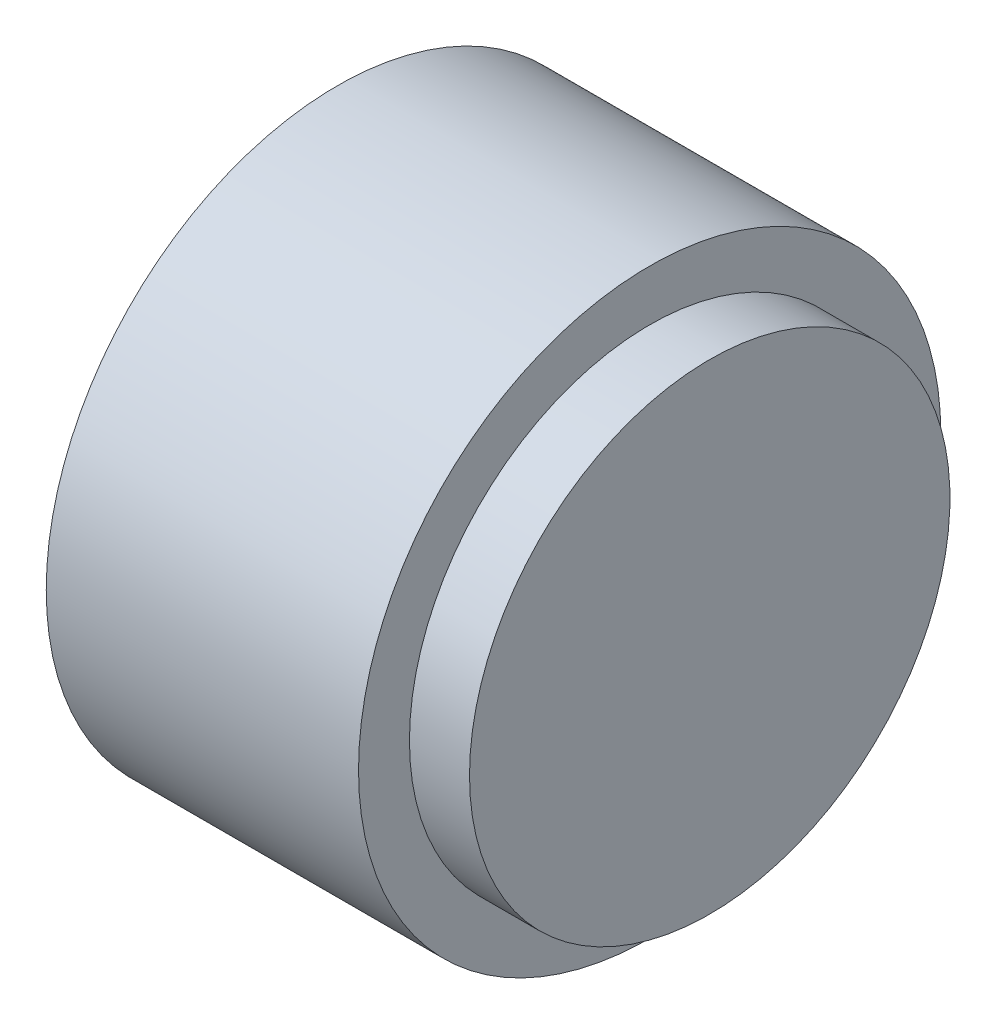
ISO-10303-21;
HEADER;
FILE_DESCRIPTION(('STEP AP214'),'2;1');
FILE_NAME('part.step','',(''),(''),'','','');
FILE_SCHEMA(('AUTOMOTIVE_DESIGN { 1 0 10303 214 1 1 1 1 }'));
ENDSEC;
DATA;
#1=APPLICATION_CONTEXT('core data for automotive mechanical design processes');
#2=APPLICATION_PROTOCOL_DEFINITION('international standard','automotive_design',2000,#1);
#3=PRODUCT_CONTEXT('',#1,'mechanical');
#4=PRODUCT('Part','Part','',(#3));
#5=PRODUCT_RELATED_PRODUCT_CATEGORY('part','',(#4));
#6=PRODUCT_DEFINITION_FORMATION('','',#4);
#7=PRODUCT_DEFINITION_CONTEXT('part definition',#1,'design');
#8=PRODUCT_DEFINITION('design','',#6,#7);
#9=PRODUCT_DEFINITION_SHAPE('','',#8);
#10=(LENGTH_UNIT() NAMED_UNIT(*) SI_UNIT(.MILLI.,.METRE.));
#11=(NAMED_UNIT(*) PLANE_ANGLE_UNIT() SI_UNIT($,.RADIAN.));
#12=(NAMED_UNIT(*) SI_UNIT($,.STERADIAN.) SOLID_ANGLE_UNIT());
#13=UNCERTAINTY_MEASURE_WITH_UNIT(LENGTH_MEASURE(1.E-05),#10,'distance_accuracy_value','');
#14=(GEOMETRIC_REPRESENTATION_CONTEXT(3) GLOBAL_UNCERTAINTY_ASSIGNED_CONTEXT((#13)) GLOBAL_UNIT_ASSIGNED_CONTEXT((#10,
#11,#12)) REPRESENTATION_CONTEXT('',''));
#15=CARTESIAN_POINT('',(0.,0.,0.));
#16=DIRECTION('',(0.,0.,1.));
#17=DIRECTION('',(1.,0.,0.));
#18=AXIS2_PLACEMENT_3D('',#15,#16,#17);
#19=CARTESIAN_POINT('',(0.,30.7848,0.));
#20=DIRECTION('',(1.,0.,0.));
#21=DIRECTION('',(0.,0.,-1.));
#22=AXIS2_PLACEMENT_3D('',#19,#20,#21);
#23=PLANE('',#22);
#24=CARTESIAN_POINT('',(0.,0.,0.));
#25=DIRECTION('',(-1.,0.,0.));
#26=DIRECTION('',(0.,0.,1.));
#27=AXIS2_PLACEMENT_3D('',#24,#25,#26);
#28=CIRCLE('',#27,30.7848);
#29=CARTESIAN_POINT('',(0.,0.,30.7848));
#30=VERTEX_POINT('',#29);
#31=EDGE_CURVE('E41',#30,#30,#28,.T.);
#32=ORIENTED_EDGE('',*,*,#31,.T.);
#33=EDGE_LOOP('',(#32));
#34=FACE_BOUND('',#33,.T.);
#35=ADVANCED_FACE('F27',(#34),#23,.F.);
#36=CARTESIAN_POINT('',(39.37,0.,0.));
#37=DIRECTION('',(-1.,0.,0.));
#38=DIRECTION('',(0.,0.,1.));
#39=AXIS2_PLACEMENT_3D('',#36,#37,#38);
#40=PLANE('',#39);
#41=CARTESIAN_POINT('',(39.37,0.,0.));
#42=DIRECTION('',(-1.,0.,0.));
#43=DIRECTION('',(0.,0.,1.));
#44=AXIS2_PLACEMENT_3D('',#41,#42,#43);
#45=CIRCLE('',#44,25.4);
#46=CARTESIAN_POINT('',(39.37,0.,25.4));
#47=VERTEX_POINT('',#46);
#48=EDGE_CURVE('E10',#47,#47,#45,.T.);
#49=ORIENTED_EDGE('',*,*,#48,.F.);
#50=EDGE_LOOP('',(#49));
#51=FACE_BOUND('',#50,.T.);
#52=ADVANCED_FACE('F61',(#51),#40,.F.);
#53=CARTESIAN_POINT('',(-81.4512072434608,0.,0.));
#54=DIRECTION('',(-1.,0.,0.));
#55=DIRECTION('',(0.,0.,1.));
#56=AXIS2_PLACEMENT_3D('',#53,#54,#55);
#57=CYLINDRICAL_SURFACE('',#56,25.4);
#58=CARTESIAN_POINT('',(33.02,0.,0.));
#59=DIRECTION('',(-1.,0.,0.));
#60=DIRECTION('',(0.,0.,1.));
#61=AXIS2_PLACEMENT_3D('',#58,#59,#60);
#62=CIRCLE('',#61,25.4);
#63=CARTESIAN_POINT('',(33.02,0.,25.4));
#64=VERTEX_POINT('',#63);
#65=EDGE_CURVE('E33',#64,#64,#62,.T.);
#66=ORIENTED_EDGE('',*,*,#65,.F.);
#67=EDGE_LOOP('',(#66));
#68=FACE_BOUND('',#67,.T.);
#69=ORIENTED_EDGE('',*,*,#48,.T.);
#70=EDGE_LOOP('',(#69));
#71=FACE_BOUND('',#70,.T.);
#72=ADVANCED_FACE('F56',(#68,#71),#57,.T.);
#73=CARTESIAN_POINT('',(33.02,25.4,0.));
#74=DIRECTION('',(-1.,0.,0.));
#75=DIRECTION('',(0.,0.,1.));
#76=AXIS2_PLACEMENT_3D('',#73,#74,#75);
#77=PLANE('',#76);
#78=CARTESIAN_POINT('',(33.02,0.,0.));
#79=DIRECTION('',(-1.,0.,0.));
#80=DIRECTION('',(0.,0.,1.));
#81=AXIS2_PLACEMENT_3D('',#78,#79,#80);
#82=CIRCLE('',#81,30.7848);
#83=CARTESIAN_POINT('',(33.02,0.,30.7848));
#84=VERTEX_POINT('',#83);
#85=EDGE_CURVE('E37',#84,#84,#82,.T.);
#86=ORIENTED_EDGE('',*,*,#85,.F.);
#87=EDGE_LOOP('',(#86));
#88=FACE_BOUND('',#87,.T.);
#89=ORIENTED_EDGE('',*,*,#65,.T.);
#90=EDGE_LOOP('',(#89));
#91=FACE_BOUND('',#90,.T.);
#92=ADVANCED_FACE('F51',(#88,#91),#77,.F.);
#93=CARTESIAN_POINT('',(-81.4512072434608,0.,0.));
#94=DIRECTION('',(-1.,0.,0.));
#95=DIRECTION('',(0.,0.,1.));
#96=AXIS2_PLACEMENT_3D('',#93,#94,#95);
#97=CYLINDRICAL_SURFACE('',#96,30.7848);
#98=ORIENTED_EDGE('',*,*,#31,.F.);
#99=EDGE_LOOP('',(#98));
#100=FACE_BOUND('',#99,.T.);
#101=ORIENTED_EDGE('',*,*,#85,.T.);
#102=EDGE_LOOP('',(#101));
#103=FACE_BOUND('',#102,.T.);
#104=ADVANCED_FACE('F48',(#100,#103),#97,.T.);
#105=CLOSED_SHELL('',(#35,#52,#72,#92,#104));
#106=MANIFOLD_SOLID_BREP('B2',#105);
#107=ADVANCED_BREP_SHAPE_REPRESENTATION('',(#18,#106),#14);
#108=SHAPE_DEFINITION_REPRESENTATION(#9,#107);
ENDSEC;
END-ISO-10303-21;
